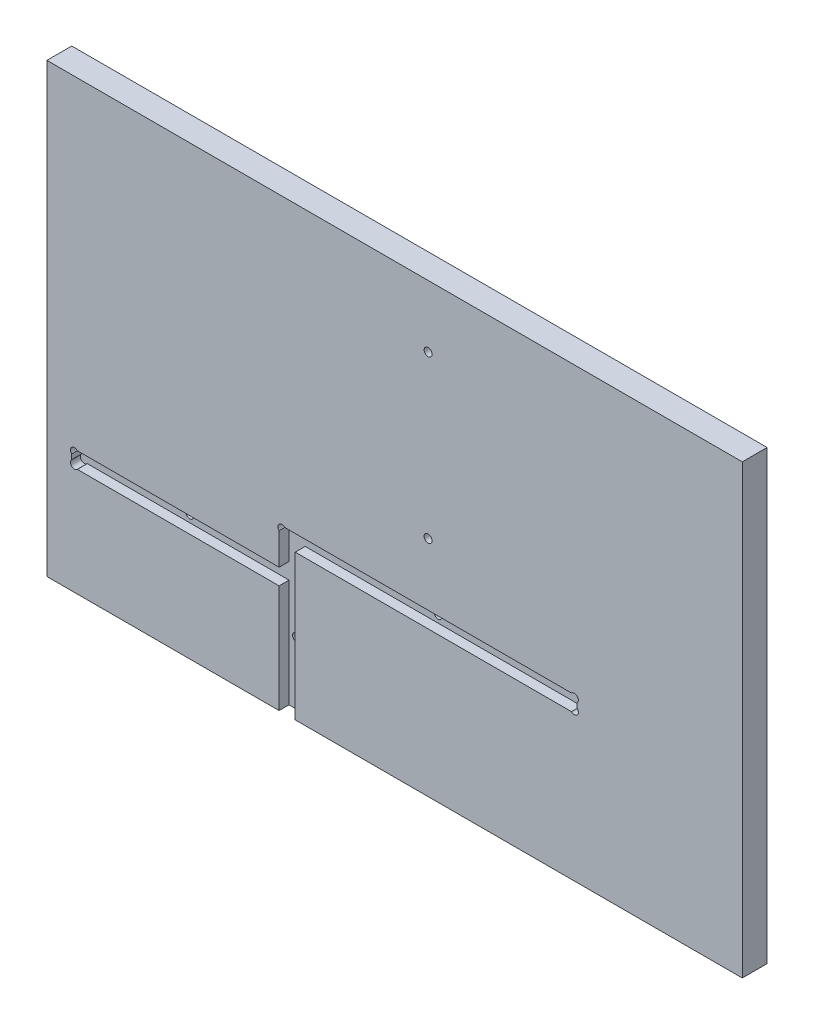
ISO-10303-21;
HEADER;
FILE_DESCRIPTION(('STEP AP214'),'2;1');
FILE_NAME('part.step','',(''),(''),'','','');
FILE_SCHEMA(('AUTOMOTIVE_DESIGN { 1 0 10303 214 1 1 1 1 }'));
ENDSEC;
DATA;
#1=APPLICATION_CONTEXT('core data for automotive mechanical design processes');
#2=APPLICATION_PROTOCOL_DEFINITION('international standard','automotive_design',2000,#1);
#3=PRODUCT_CONTEXT('',#1,'mechanical');
#4=PRODUCT('Part','Part','',(#3));
#5=PRODUCT_RELATED_PRODUCT_CATEGORY('part','',(#4));
#6=PRODUCT_DEFINITION_FORMATION('','',#4);
#7=PRODUCT_DEFINITION_CONTEXT('part definition',#1,'design');
#8=PRODUCT_DEFINITION('design','',#6,#7);
#9=PRODUCT_DEFINITION_SHAPE('','',#8);
#10=(LENGTH_UNIT() NAMED_UNIT(*) SI_UNIT(.MILLI.,.METRE.));
#11=(NAMED_UNIT(*) PLANE_ANGLE_UNIT() SI_UNIT($,.RADIAN.));
#12=(NAMED_UNIT(*) SI_UNIT($,.STERADIAN.) SOLID_ANGLE_UNIT());
#13=UNCERTAINTY_MEASURE_WITH_UNIT(LENGTH_MEASURE(1.E-05),#10,'distance_accuracy_value','');
#14=(GEOMETRIC_REPRESENTATION_CONTEXT(3) GLOBAL_UNCERTAINTY_ASSIGNED_CONTEXT((#13)) GLOBAL_UNIT_ASSIGNED_CONTEXT((#10,
#11,#12)) REPRESENTATION_CONTEXT('',''));
#15=CARTESIAN_POINT('',(0.,0.,0.));
#16=DIRECTION('',(0.,0.,1.));
#17=DIRECTION('',(1.,0.,0.));
#18=AXIS2_PLACEMENT_3D('',#15,#16,#17);
#19=CARTESIAN_POINT('',(-70.,40.,10.));
#20=DIRECTION('',(1.,0.,0.));
#21=DIRECTION('',(0.,1.,0.));
#22=AXIS2_PLACEMENT_3D('',#19,#20,#21);
#23=PLANE('',#22);
#24=DIRECTION('',(0.,-1.,0.));
#25=VECTOR('',#24,1.);
#26=CARTESIAN_POINT('',(-70.,40.,0.));
#27=LINE('',#26,#25);
#28=CARTESIAN_POINT('',(-70.,40.,0.));
#29=VERTEX_POINT('',#28);
#30=CARTESIAN_POINT('',(-70.,-140.,0.));
#31=VERTEX_POINT('',#30);
#32=EDGE_CURVE('E217',#29,#31,#27,.T.);
#33=ORIENTED_EDGE('',*,*,#32,.T.);
#34=DIRECTION('',(0.,0.,-1.));
#35=VECTOR('',#34,1.);
#36=CARTESIAN_POINT('',(-70.,-140.,10.));
#37=LINE('',#36,#35);
#38=CARTESIAN_POINT('',(-70.,-140.,10.));
#39=VERTEX_POINT('',#38);
#40=EDGE_CURVE('E11',#39,#31,#37,.T.);
#41=ORIENTED_EDGE('',*,*,#40,.F.);
#42=DIRECTION('',(0.,-1.,0.));
#43=VECTOR('',#42,1.);
#44=CARTESIAN_POINT('',(-70.,40.,10.));
#45=LINE('',#44,#43);
#46=CARTESIAN_POINT('',(-70.,40.,10.));
#47=VERTEX_POINT('',#46);
#48=EDGE_CURVE('E185',#47,#39,#45,.T.);
#49=ORIENTED_EDGE('',*,*,#48,.F.);
#50=DIRECTION('',(0.,0.,-1.));
#51=VECTOR('',#50,1.);
#52=CARTESIAN_POINT('',(-70.,40.,10.));
#53=LINE('',#52,#51);
#54=EDGE_CURVE('E196',#47,#29,#53,.T.);
#55=ORIENTED_EDGE('',*,*,#54,.T.);
#56=EDGE_LOOP('',(#33,#41,#49,#55));
#57=FACE_BOUND('',#56,.T.);
#58=ADVANCED_FACE('F27',(#57),#23,.F.);
#59=CARTESIAN_POINT('',(-70.,-140.,10.));
#60=DIRECTION('',(0.,1.,0.));
#61=DIRECTION('',(0.,0.,1.));
#62=AXIS2_PLACEMENT_3D('',#59,#60,#61);
#63=PLANE('',#62);
#64=DIRECTION('',(1.,0.,0.));
#65=VECTOR('',#64,1.);
#66=CARTESIAN_POINT('',(23.5,-140.,6.));
#67=LINE('',#66,#65);
#68=CARTESIAN_POINT('',(23.5,-140.,6.));
#69=VERTEX_POINT('',#68);
#70=CARTESIAN_POINT('',(30.,-140.,6.));
#71=VERTEX_POINT('',#70);
#72=EDGE_CURVE('E178',#69,#71,#67,.T.);
#73=ORIENTED_EDGE('',*,*,#72,.F.);
#74=DIRECTION('',(0.,0.,1.));
#75=VECTOR('',#74,1.);
#76=CARTESIAN_POINT('',(23.5,-140.,6.));
#77=LINE('',#76,#75);
#78=CARTESIAN_POINT('',(23.5,-140.,10.));
#79=VERTEX_POINT('',#78);
#80=EDGE_CURVE('E161',#69,#79,#77,.T.);
#81=ORIENTED_EDGE('',*,*,#80,.T.);
#82=DIRECTION('',(1.,0.,0.));
#83=VECTOR('',#82,1.);
#84=CARTESIAN_POINT('',(-70.,-140.,10.));
#85=LINE('',#84,#83);
#86=EDGE_CURVE('E174',#39,#79,#85,.T.);
#87=ORIENTED_EDGE('',*,*,#86,.F.);
#88=ORIENTED_EDGE('',*,*,#40,.T.);
#89=DIRECTION('',(1.,0.,0.));
#90=VECTOR('',#89,1.);
#91=CARTESIAN_POINT('',(-70.,-140.,0.));
#92=LINE('',#91,#90);
#93=CARTESIAN_POINT('',(210.,-140.,0.));
#94=VERTEX_POINT('',#93);
#95=EDGE_CURVE('E214',#31,#94,#92,.T.);
#96=ORIENTED_EDGE('',*,*,#95,.T.);
#97=DIRECTION('',(0.,0.,-1.));
#98=VECTOR('',#97,1.);
#99=CARTESIAN_POINT('',(210.,-140.,10.));
#100=LINE('',#99,#98);
#101=CARTESIAN_POINT('',(210.,-140.,10.));
#102=VERTEX_POINT('',#101);
#103=EDGE_CURVE('E34',#102,#94,#100,.T.);
#104=ORIENTED_EDGE('',*,*,#103,.F.);
#105=CARTESIAN_POINT('',(30.,-140.,10.));
#106=VERTEX_POINT('',#105);
#107=EDGE_CURVE('E188',#106,#102,#85,.T.);
#108=ORIENTED_EDGE('',*,*,#107,.F.);
#109=DIRECTION('',(0.,0.,1.));
#110=VECTOR('',#109,1.);
#111=CARTESIAN_POINT('',(30.,-140.,6.));
#112=LINE('',#111,#110);
#113=EDGE_CURVE('E179',#71,#106,#112,.T.);
#114=ORIENTED_EDGE('',*,*,#113,.F.);
#115=EDGE_LOOP('',(#73,#81,#87,#88,#96,#104,#108,#114));
#116=FACE_BOUND('',#115,.T.);
#117=ADVANCED_FACE('F173',(#116),#63,.F.);
#118=CARTESIAN_POINT('',(210.,40.,10.));
#119=DIRECTION('',(-1.,0.,0.));
#120=DIRECTION('',(0.,0.,1.));
#121=AXIS2_PLACEMENT_3D('',#118,#119,#120);
#122=PLANE('',#121);
#123=DIRECTION('',(0.,1.,0.));
#124=VECTOR('',#123,1.);
#125=CARTESIAN_POINT('',(210.,40.,0.));
#126=LINE('',#125,#124);
#127=CARTESIAN_POINT('',(210.,40.,0.));
#128=VERTEX_POINT('',#127);
#129=EDGE_CURVE('E208',#94,#128,#126,.T.);
#130=ORIENTED_EDGE('',*,*,#129,.T.);
#131=DIRECTION('',(0.,0.,-1.));
#132=VECTOR('',#131,1.);
#133=CARTESIAN_POINT('',(210.,40.,10.));
#134=LINE('',#133,#132);
#135=CARTESIAN_POINT('',(210.,40.,10.));
#136=VERTEX_POINT('',#135);
#137=EDGE_CURVE('E199',#136,#128,#134,.T.);
#138=ORIENTED_EDGE('',*,*,#137,.F.);
#139=DIRECTION('',(0.,1.,0.));
#140=VECTOR('',#139,1.);
#141=CARTESIAN_POINT('',(210.,40.,10.));
#142=LINE('',#141,#140);
#143=EDGE_CURVE('E187',#102,#136,#142,.T.);
#144=ORIENTED_EDGE('',*,*,#143,.F.);
#145=ORIENTED_EDGE('',*,*,#103,.T.);
#146=EDGE_LOOP('',(#130,#138,#144,#145));
#147=FACE_BOUND('',#146,.T.);
#148=ADVANCED_FACE('F206',(#147),#122,.F.);
#149=CARTESIAN_POINT('',(-70.,40.,10.));
#150=DIRECTION('',(0.,-1.,0.));
#151=DIRECTION('',(0.,0.,-1.));
#152=AXIS2_PLACEMENT_3D('',#149,#150,#151);
#153=PLANE('',#152);
#154=DIRECTION('',(-1.,0.,0.));
#155=VECTOR('',#154,1.);
#156=CARTESIAN_POINT('',(-70.,40.,0.));
#157=LINE('',#156,#155);
#158=EDGE_CURVE('E215',#128,#29,#157,.T.);
#159=ORIENTED_EDGE('',*,*,#158,.T.);
#160=ORIENTED_EDGE('',*,*,#54,.F.);
#161=DIRECTION('',(-1.,0.,0.));
#162=VECTOR('',#161,1.);
#163=CARTESIAN_POINT('',(-70.,40.,10.));
#164=LINE('',#163,#162);
#165=EDGE_CURVE('E190',#136,#47,#164,.T.);
#166=ORIENTED_EDGE('',*,*,#165,.F.);
#167=ORIENTED_EDGE('',*,*,#137,.T.);
#168=EDGE_LOOP('',(#159,#160,#166,#167));
#169=FACE_BOUND('',#168,.T.);
#170=ADVANCED_FACE('F424',(#169),#153,.F.);
#171=CARTESIAN_POINT('',(-70.,-140.,10.));
#172=DIRECTION('',(0.,0.,1.));
#173=DIRECTION('',(1.,0.,0.));
#174=AXIS2_PLACEMENT_3D('',#171,#172,#173);
#175=PLANE('',#174);
#176=DIRECTION('',(-1.,0.,0.));
#177=VECTOR('',#176,1.);
#178=CARTESIAN_POINT('',(-60.,-90.,10.));
#179=LINE('',#178,#177);
#180=CARTESIAN_POINT('',(23.5,-90.,10.));
#181=VERTEX_POINT('',#180);
#182=CARTESIAN_POINT('',(-57.7381049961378,-90.,10.));
#183=VERTEX_POINT('',#182);
#184=EDGE_CURVE('E247',#181,#183,#179,.T.);
#185=ORIENTED_EDGE('',*,*,#184,.F.);
#186=DIRECTION('',(0.,-1.,0.));
#187=VECTOR('',#186,1.);
#188=CARTESIAN_POINT('',(23.5,-75.,10.));
#189=LINE('',#188,#187);
#190=CARTESIAN_POINT('',(23.5,-77.2618950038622,10.));
#191=VERTEX_POINT('',#190);
#192=EDGE_CURVE('E237',#191,#181,#189,.T.);
#193=ORIENTED_EDGE('',*,*,#192,.F.);
#194=CARTESIAN_POINT('',(24.6,-76.1,10.));
#195=DIRECTION('',(0.,0.,1.));
#196=DIRECTION('',(1.,0.,0.));
#197=AXIS2_PLACEMENT_3D('',#194,#195,#196);
#198=CIRCLE('',#197,1.60000000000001);
#199=CARTESIAN_POINT('',(25.7618950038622,-75.,10.));
#200=VERTEX_POINT('',#199);
#201=EDGE_CURVE('E286',#200,#191,#198,.T.);
#202=ORIENTED_EDGE('',*,*,#201,.F.);
#203=DIRECTION('',(-1.,0.,0.));
#204=VECTOR('',#203,1.);
#205=CARTESIAN_POINT('',(23.5,-75.,10.));
#206=LINE('',#205,#204);
#207=CARTESIAN_POINT('',(141.238104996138,-75.,10.));
#208=VERTEX_POINT('',#207);
#209=EDGE_CURVE('E230',#208,#200,#206,.T.);
#210=ORIENTED_EDGE('',*,*,#209,.F.);
#211=CARTESIAN_POINT('',(142.4,-76.1,10.));
#212=DIRECTION('',(0.,0.,1.));
#213=DIRECTION('',(1.,0.,0.));
#214=AXIS2_PLACEMENT_3D('',#211,#212,#213);
#215=CIRCLE('',#214,1.59999999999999);
#216=CARTESIAN_POINT('',(143.5,-77.2618950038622,10.));
#217=VERTEX_POINT('',#216);
#218=EDGE_CURVE('E265',#217,#208,#215,.T.);
#219=ORIENTED_EDGE('',*,*,#218,.F.);
#220=DIRECTION('',(0.,1.,0.));
#221=VECTOR('',#220,1.);
#222=CARTESIAN_POINT('',(143.5,-75.,10.));
#223=LINE('',#222,#221);
#224=CARTESIAN_POINT('',(143.5,-79.2381049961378,10.));
#225=VERTEX_POINT('',#224);
#226=EDGE_CURVE('E233',#225,#217,#223,.T.);
#227=ORIENTED_EDGE('',*,*,#226,.F.);
#228=CARTESIAN_POINT('',(142.4,-80.4,10.));
#229=DIRECTION('',(0.,0.,1.));
#230=DIRECTION('',(1.,0.,0.));
#231=AXIS2_PLACEMENT_3D('',#228,#229,#230);
#232=CIRCLE('',#231,1.59999999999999);
#233=CARTESIAN_POINT('',(141.238104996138,-81.5,10.));
#234=VERTEX_POINT('',#233);
#235=EDGE_CURVE('E276',#234,#225,#232,.T.);
#236=ORIENTED_EDGE('',*,*,#235,.F.);
#237=DIRECTION('',(1.,0.,0.));
#238=VECTOR('',#237,1.);
#239=CARTESIAN_POINT('',(23.5,-81.5,10.));
#240=LINE('',#239,#238);
#241=CARTESIAN_POINT('',(30.,-81.5,10.));
#242=VERTEX_POINT('',#241);
#243=EDGE_CURVE('E235',#242,#234,#240,.T.);
#244=ORIENTED_EDGE('',*,*,#243,.F.);
#245=DIRECTION('',(0.,1.,0.));
#246=VECTOR('',#245,1.);
#247=CARTESIAN_POINT('',(30.,-90.,10.));
#248=LINE('',#247,#246);
#249=EDGE_CURVE('E249',#106,#242,#248,.T.);
#250=ORIENTED_EDGE('',*,*,#249,.F.);
#251=ORIENTED_EDGE('',*,*,#107,.T.);
#252=ORIENTED_EDGE('',*,*,#143,.T.);
#253=ORIENTED_EDGE('',*,*,#165,.T.);
#254=ORIENTED_EDGE('',*,*,#48,.T.);
#255=ORIENTED_EDGE('',*,*,#86,.T.);
#256=DIRECTION('',(0.,-1.,0.));
#257=VECTOR('',#256,1.);
#258=CARTESIAN_POINT('',(23.5,-81.5,10.));
#259=LINE('',#258,#257);
#260=CARTESIAN_POINT('',(23.5,-96.5,10.));
#261=VERTEX_POINT('',#260);
#262=EDGE_CURVE('E158',#261,#79,#259,.T.);
#263=ORIENTED_EDGE('',*,*,#262,.F.);
#264=DIRECTION('',(1.,0.,0.));
#265=VECTOR('',#264,1.);
#266=CARTESIAN_POINT('',(-60.,-96.5,10.));
#267=LINE('',#266,#265);
#268=CARTESIAN_POINT('',(-57.7381049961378,-96.5,10.));
#269=VERTEX_POINT('',#268);
#270=EDGE_CURVE('E251',#269,#261,#267,.T.);
#271=ORIENTED_EDGE('',*,*,#270,.F.);
#272=CARTESIAN_POINT('',(-58.9,-95.4,10.));
#273=DIRECTION('',(0.,0.,1.));
#274=DIRECTION('',(1.,0.,0.));
#275=AXIS2_PLACEMENT_3D('',#272,#273,#274);
#276=CIRCLE('',#275,1.6);
#277=CARTESIAN_POINT('',(-60.,-94.2381049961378,10.));
#278=VERTEX_POINT('',#277);
#279=EDGE_CURVE('E306',#278,#269,#276,.T.);
#280=ORIENTED_EDGE('',*,*,#279,.F.);
#281=DIRECTION('',(0.,-1.,0.));
#282=VECTOR('',#281,1.);
#283=CARTESIAN_POINT('',(-60.,-90.,10.));
#284=LINE('',#283,#282);
#285=CARTESIAN_POINT('',(-60.,-92.2618950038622,10.));
#286=VERTEX_POINT('',#285);
#287=EDGE_CURVE('E253',#286,#278,#284,.T.);
#288=ORIENTED_EDGE('',*,*,#287,.F.);
#289=CARTESIAN_POINT('',(-58.9,-91.1,10.));
#290=DIRECTION('',(0.,0.,1.));
#291=DIRECTION('',(1.,0.,0.));
#292=AXIS2_PLACEMENT_3D('',#289,#290,#291);
#293=CIRCLE('',#292,1.6);
#294=EDGE_CURVE('E297',#183,#286,#293,.T.);
#295=ORIENTED_EDGE('',*,*,#294,.F.);
#296=EDGE_LOOP('',(#185,#193,#202,#210,#219,#227,#236,#244,#250,#251,#252,#253,#254,#255,#263,
#271,#280,#288,#295));
#297=FACE_BOUND('',#296,.T.);
#298=CARTESIAN_POINT('',(83.4999999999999,15.,10.));
#299=DIRECTION('',(0.,0.,1.));
#300=DIRECTION('',(1.,0.,0.));
#301=AXIS2_PLACEMENT_3D('',#298,#299,#300);
#302=CIRCLE('',#301,1.6);
#303=CARTESIAN_POINT('',(85.1,15.,10.));
#304=VERTEX_POINT('',#303);
#305=EDGE_CURVE('E317',#304,#304,#302,.T.);
#306=ORIENTED_EDGE('',*,*,#305,.F.);
#307=EDGE_LOOP('',(#306));
#308=FACE_BOUND('',#307,.T.);
#309=CARTESIAN_POINT('',(83.5,-50.,10.));
#310=DIRECTION('',(0.,0.,1.));
#311=DIRECTION('',(1.,0.,0.));
#312=AXIS2_PLACEMENT_3D('',#309,#310,#311);
#313=CIRCLE('',#312,1.60000000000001);
#314=CARTESIAN_POINT('',(85.1,-50.,10.));
#315=VERTEX_POINT('',#314);
#316=EDGE_CURVE('E311',#315,#315,#313,.T.);
#317=ORIENTED_EDGE('',*,*,#316,.F.);
#318=EDGE_LOOP('',(#317));
#319=FACE_BOUND('',#318,.T.);
#320=ADVANCED_FACE('F182',(#297,#308,#319),#175,.T.);
#321=CARTESIAN_POINT('',(-70.,-140.,0.));
#322=DIRECTION('',(0.,0.,1.));
#323=DIRECTION('',(1.,0.,0.));
#324=AXIS2_PLACEMENT_3D('',#321,#322,#323);
#325=PLANE('',#324);
#326=CARTESIAN_POINT('',(-16.5,-93.5,0.));
#327=DIRECTION('',(0.,0.,1.));
#328=DIRECTION('',(1.,0.,0.));
#329=AXIS2_PLACEMENT_3D('',#326,#327,#328);
#330=CIRCLE('',#329,1.6);
#331=CARTESIAN_POINT('',(-14.9,-93.5,0.));
#332=VERTEX_POINT('',#331);
#333=EDGE_CURVE('E342',#332,#332,#330,.T.);
#334=ORIENTED_EDGE('',*,*,#333,.T.);
#335=EDGE_LOOP('',(#334));
#336=FACE_BOUND('',#335,.T.);
#337=CARTESIAN_POINT('',(26.5,-115.,0.));
#338=DIRECTION('',(0.,0.,1.));
#339=DIRECTION('',(1.,0.,0.));
#340=AXIS2_PLACEMENT_3D('',#337,#338,#339);
#341=CIRCLE('',#340,1.60000000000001);
#342=CARTESIAN_POINT('',(28.1,-115.,0.));
#343=VERTEX_POINT('',#342);
#344=EDGE_CURVE('E336',#343,#343,#341,.T.);
#345=ORIENTED_EDGE('',*,*,#344,.T.);
#346=EDGE_LOOP('',(#345));
#347=FACE_BOUND('',#346,.T.);
#348=CARTESIAN_POINT('',(83.4999999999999,-78.5,0.));
#349=DIRECTION('',(0.,0.,1.));
#350=DIRECTION('',(1.,0.,0.));
#351=AXIS2_PLACEMENT_3D('',#348,#349,#350);
#352=CIRCLE('',#351,1.60000000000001);
#353=CARTESIAN_POINT('',(85.1,-78.5,0.));
#354=VERTEX_POINT('',#353);
#355=EDGE_CURVE('E170',#354,#354,#352,.T.);
#356=ORIENTED_EDGE('',*,*,#355,.T.);
#357=EDGE_LOOP('',(#356));
#358=FACE_BOUND('',#357,.T.);
#359=CARTESIAN_POINT('',(83.4999999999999,15.,0.));
#360=DIRECTION('',(0.,0.,1.));
#361=DIRECTION('',(1.,0.,0.));
#362=AXIS2_PLACEMENT_3D('',#359,#360,#361);
#363=CIRCLE('',#362,1.6);
#364=CARTESIAN_POINT('',(85.1,15.,0.));
#365=VERTEX_POINT('',#364);
#366=EDGE_CURVE('E314',#365,#365,#363,.T.);
#367=ORIENTED_EDGE('',*,*,#366,.T.);
#368=EDGE_LOOP('',(#367));
#369=FACE_BOUND('',#368,.T.);
#370=CARTESIAN_POINT('',(83.5,-50.,0.));
#371=DIRECTION('',(0.,0.,1.));
#372=DIRECTION('',(1.,0.,0.));
#373=AXIS2_PLACEMENT_3D('',#370,#371,#372);
#374=CIRCLE('',#373,1.60000000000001);
#375=CARTESIAN_POINT('',(85.1,-50.,0.));
#376=VERTEX_POINT('',#375);
#377=EDGE_CURVE('E308',#376,#376,#374,.T.);
#378=ORIENTED_EDGE('',*,*,#377,.T.);
#379=EDGE_LOOP('',(#378));
#380=FACE_BOUND('',#379,.T.);
#381=ORIENTED_EDGE('',*,*,#32,.F.);
#382=ORIENTED_EDGE('',*,*,#158,.F.);
#383=ORIENTED_EDGE('',*,*,#129,.F.);
#384=ORIENTED_EDGE('',*,*,#95,.F.);
#385=EDGE_LOOP('',(#381,#382,#383,#384));
#386=FACE_BOUND('',#385,.T.);
#387=ADVANCED_FACE('F213',(#336,#347,#358,#369,#380,#386),#325,.F.);
#388=CARTESIAN_POINT('',(23.5,-75.,6.));
#389=DIRECTION('',(-1.,0.,0.));
#390=DIRECTION('',(0.,-1.,0.));
#391=AXIS2_PLACEMENT_3D('',#388,#389,#390);
#392=PLANE('',#391);
#393=DIRECTION('',(0.,-1.,0.));
#394=VECTOR('',#393,1.);
#395=CARTESIAN_POINT('',(23.5,-75.,6.));
#396=LINE('',#395,#394);
#397=CARTESIAN_POINT('',(23.5,-77.2618950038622,6.));
#398=VERTEX_POINT('',#397);
#399=CARTESIAN_POINT('',(23.4999999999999,-90.,6.));
#400=VERTEX_POINT('',#399);
#401=EDGE_CURVE('E41',#398,#400,#396,.T.);
#402=ORIENTED_EDGE('',*,*,#401,.F.);
#403=DIRECTION('',(0.,0.,1.));
#404=VECTOR('',#403,1.);
#405=CARTESIAN_POINT('',(23.5,-77.2618950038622,6.));
#406=LINE('',#405,#404);
#407=EDGE_CURVE('E278',#398,#191,#406,.T.);
#408=ORIENTED_EDGE('',*,*,#407,.T.);
#409=ORIENTED_EDGE('',*,*,#192,.T.);
#410=DIRECTION('',(0.,0.,1.));
#411=VECTOR('',#410,1.);
#412=CARTESIAN_POINT('',(23.4999999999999,-90.,6.));
#413=LINE('',#412,#411);
#414=EDGE_CURVE('E320',#400,#181,#413,.T.);
#415=ORIENTED_EDGE('',*,*,#414,.F.);
#416=EDGE_LOOP('',(#402,#408,#409,#415));
#417=FACE_BOUND('',#416,.T.);
#418=ADVANCED_FACE('F363',(#417),#392,.F.);
#419=CARTESIAN_POINT('',(23.5,-75.,6.));
#420=DIRECTION('',(0.,1.,0.));
#421=DIRECTION('',(-1.,0.,0.));
#422=AXIS2_PLACEMENT_3D('',#419,#420,#421);
#423=PLANE('',#422);
#424=ORIENTED_EDGE('',*,*,#209,.T.);
#425=DIRECTION('',(0.,0.,1.));
#426=VECTOR('',#425,1.);
#427=CARTESIAN_POINT('',(25.7618950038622,-75.,6.));
#428=LINE('',#427,#426);
#429=CARTESIAN_POINT('',(25.7618950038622,-75.,6.));
#430=VERTEX_POINT('',#429);
#431=EDGE_CURVE('E281',#200,#430,#428,.F.);
#432=ORIENTED_EDGE('',*,*,#431,.T.);
#433=DIRECTION('',(-1.,0.,0.));
#434=VECTOR('',#433,1.);
#435=CARTESIAN_POINT('',(23.5,-75.,6.));
#436=LINE('',#435,#434);
#437=CARTESIAN_POINT('',(141.238104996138,-75.,6.));
#438=VERTEX_POINT('',#437);
#439=EDGE_CURVE('E222',#438,#430,#436,.T.);
#440=ORIENTED_EDGE('',*,*,#439,.F.);
#441=DIRECTION('',(0.,0.,1.));
#442=VECTOR('',#441,1.);
#443=CARTESIAN_POINT('',(141.238104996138,-75.,6.));
#444=LINE('',#443,#442);
#445=EDGE_CURVE('E256',#438,#208,#444,.T.);
#446=ORIENTED_EDGE('',*,*,#445,.T.);
#447=EDGE_LOOP('',(#424,#432,#440,#446));
#448=FACE_BOUND('',#447,.T.);
#449=ADVANCED_FACE('F405',(#448),#423,.F.);
#450=CARTESIAN_POINT('',(143.5,-75.,6.));
#451=DIRECTION('',(1.,0.,0.));
#452=DIRECTION('',(0.,0.,-1.));
#453=AXIS2_PLACEMENT_3D('',#450,#451,#452);
#454=PLANE('',#453);
#455=DIRECTION('',(0.,1.,0.));
#456=VECTOR('',#455,1.);
#457=CARTESIAN_POINT('',(143.5,-75.,6.));
#458=LINE('',#457,#456);
#459=CARTESIAN_POINT('',(143.5,-79.2381049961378,6.));
#460=VERTEX_POINT('',#459);
#461=CARTESIAN_POINT('',(143.5,-77.2618950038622,6.));
#462=VERTEX_POINT('',#461);
#463=EDGE_CURVE('E225',#460,#462,#458,.T.);
#464=ORIENTED_EDGE('',*,*,#463,.F.);
#465=DIRECTION('',(0.,0.,1.));
#466=VECTOR('',#465,1.);
#467=CARTESIAN_POINT('',(143.5,-79.2381049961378,6.));
#468=LINE('',#467,#466);
#469=EDGE_CURVE('E267',#460,#225,#468,.T.);
#470=ORIENTED_EDGE('',*,*,#469,.T.);
#471=ORIENTED_EDGE('',*,*,#226,.T.);
#472=DIRECTION('',(0.,0.,1.));
#473=VECTOR('',#472,1.);
#474=CARTESIAN_POINT('',(143.5,-77.2618950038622,6.));
#475=LINE('',#474,#473);
#476=EDGE_CURVE('E259',#217,#462,#475,.F.);
#477=ORIENTED_EDGE('',*,*,#476,.T.);
#478=EDGE_LOOP('',(#464,#470,#471,#477));
#479=FACE_BOUND('',#478,.T.);
#480=ADVANCED_FACE('F396',(#479),#454,.F.);
#481=CARTESIAN_POINT('',(23.5,-81.5,6.));
#482=DIRECTION('',(0.,-1.,0.));
#483=DIRECTION('',(0.,0.,-1.));
#484=AXIS2_PLACEMENT_3D('',#481,#482,#483);
#485=PLANE('',#484);
#486=DIRECTION('',(1.,0.,0.));
#487=VECTOR('',#486,1.);
#488=CARTESIAN_POINT('',(23.5,-81.5,6.));
#489=LINE('',#488,#487);
#490=CARTESIAN_POINT('',(30.,-81.5,6.));
#491=VERTEX_POINT('',#490);
#492=CARTESIAN_POINT('',(141.238104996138,-81.5,6.));
#493=VERTEX_POINT('',#492);
#494=EDGE_CURVE('E227',#491,#493,#489,.T.);
#495=ORIENTED_EDGE('',*,*,#494,.F.);
#496=DIRECTION('',(0.,0.,1.));
#497=VECTOR('',#496,1.);
#498=CARTESIAN_POINT('',(30.,-81.5,6.));
#499=LINE('',#498,#497);
#500=EDGE_CURVE('E323',#491,#242,#499,.T.);
#501=ORIENTED_EDGE('',*,*,#500,.T.);
#502=ORIENTED_EDGE('',*,*,#243,.T.);
#503=DIRECTION('',(0.,0.,1.));
#504=VECTOR('',#503,1.);
#505=CARTESIAN_POINT('',(141.238104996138,-81.5,6.));
#506=LINE('',#505,#504);
#507=EDGE_CURVE('E270',#234,#493,#506,.F.);
#508=ORIENTED_EDGE('',*,*,#507,.T.);
#509=EDGE_LOOP('',(#495,#501,#502,#508));
#510=FACE_BOUND('',#509,.T.);
#511=ADVANCED_FACE('F355',(#510),#485,.F.);
#512=CARTESIAN_POINT('',(23.5,-81.5,6.));
#513=DIRECTION('',(0.,0.,1.));
#514=DIRECTION('',(1.,0.,0.));
#515=AXIS2_PLACEMENT_3D('',#512,#513,#514);
#516=PLANE('',#515);
#517=CARTESIAN_POINT('',(-16.5,-93.5,6.));
#518=DIRECTION('',(0.,0.,1.));
#519=DIRECTION('',(1.,0.,0.));
#520=AXIS2_PLACEMENT_3D('',#517,#518,#519);
#521=CIRCLE('',#520,1.6);
#522=CARTESIAN_POINT('',(-14.9,-93.5,6.));
#523=VERTEX_POINT('',#522);
#524=EDGE_CURVE('E345',#523,#523,#521,.T.);
#525=ORIENTED_EDGE('',*,*,#524,.F.);
#526=EDGE_LOOP('',(#525));
#527=FACE_BOUND('',#526,.T.);
#528=CARTESIAN_POINT('',(26.5,-115.,6.));
#529=DIRECTION('',(0.,0.,1.));
#530=DIRECTION('',(1.,0.,0.));
#531=AXIS2_PLACEMENT_3D('',#528,#529,#530);
#532=CIRCLE('',#531,1.60000000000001);
#533=CARTESIAN_POINT('',(28.1,-115.,6.));
#534=VERTEX_POINT('',#533);
#535=EDGE_CURVE('E339',#534,#534,#532,.T.);
#536=ORIENTED_EDGE('',*,*,#535,.F.);
#537=EDGE_LOOP('',(#536));
#538=FACE_BOUND('',#537,.T.);
#539=CARTESIAN_POINT('',(83.4999999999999,-78.5,6.));
#540=DIRECTION('',(0.,0.,1.));
#541=DIRECTION('',(1.,0.,0.));
#542=AXIS2_PLACEMENT_3D('',#539,#540,#541);
#543=CIRCLE('',#542,1.60000000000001);
#544=CARTESIAN_POINT('',(85.1,-78.5,6.));
#545=VERTEX_POINT('',#544);
#546=EDGE_CURVE('E333',#545,#545,#543,.T.);
#547=ORIENTED_EDGE('',*,*,#546,.F.);
#548=EDGE_LOOP('',(#547));
#549=FACE_BOUND('',#548,.T.);
#550=CARTESIAN_POINT('',(24.6,-76.1,6.));
#551=DIRECTION('',(0.,0.,1.));
#552=DIRECTION('',(1.,0.,0.));
#553=AXIS2_PLACEMENT_3D('',#550,#551,#552);
#554=CIRCLE('',#553,1.60000000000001);
#555=EDGE_CURVE('E284',#430,#398,#554,.T.);
#556=ORIENTED_EDGE('',*,*,#555,.T.);
#557=ORIENTED_EDGE('',*,*,#401,.T.);
#558=DIRECTION('',(-1.,0.,0.));
#559=VECTOR('',#558,1.);
#560=CARTESIAN_POINT('',(-60.,-90.,6.));
#561=LINE('',#560,#559);
#562=CARTESIAN_POINT('',(-57.7381049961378,-90.,6.));
#563=VERTEX_POINT('',#562);
#564=EDGE_CURVE('E239',#400,#563,#561,.T.);
#565=ORIENTED_EDGE('',*,*,#564,.T.);
#566=CARTESIAN_POINT('',(-58.9,-91.1,6.));
#567=DIRECTION('',(0.,0.,1.));
#568=DIRECTION('',(1.,0.,0.));
#569=AXIS2_PLACEMENT_3D('',#566,#567,#568);
#570=CIRCLE('',#569,1.6);
#571=CARTESIAN_POINT('',(-60.,-92.2618950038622,6.));
#572=VERTEX_POINT('',#571);
#573=EDGE_CURVE('E294',#563,#572,#570,.T.);
#574=ORIENTED_EDGE('',*,*,#573,.T.);
#575=DIRECTION('',(0.,-1.,0.));
#576=VECTOR('',#575,1.);
#577=CARTESIAN_POINT('',(-60.,-90.,6.));
#578=LINE('',#577,#576);
#579=CARTESIAN_POINT('',(-60.,-94.2381049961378,6.));
#580=VERTEX_POINT('',#579);
#581=EDGE_CURVE('E245',#572,#580,#578,.T.);
#582=ORIENTED_EDGE('',*,*,#581,.T.);
#583=CARTESIAN_POINT('',(-58.9,-95.4,6.));
#584=DIRECTION('',(0.,0.,1.));
#585=DIRECTION('',(1.,0.,0.));
#586=AXIS2_PLACEMENT_3D('',#583,#584,#585);
#587=CIRCLE('',#586,1.6);
#588=CARTESIAN_POINT('',(-57.7381049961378,-96.5,6.));
#589=VERTEX_POINT('',#588);
#590=EDGE_CURVE('E48',#580,#589,#587,.T.);
#591=ORIENTED_EDGE('',*,*,#590,.T.);
#592=DIRECTION('',(1.,0.,0.));
#593=VECTOR('',#592,1.);
#594=CARTESIAN_POINT('',(-60.,-96.5,6.));
#595=LINE('',#594,#593);
#596=CARTESIAN_POINT('',(23.5,-96.5,6.));
#597=VERTEX_POINT('',#596);
#598=EDGE_CURVE('E243',#589,#597,#595,.T.);
#599=ORIENTED_EDGE('',*,*,#598,.T.);
#600=DIRECTION('',(0.,-1.,0.));
#601=VECTOR('',#600,1.);
#602=CARTESIAN_POINT('',(23.5,-81.5,6.));
#603=LINE('',#602,#601);
#604=EDGE_CURVE('E169',#597,#69,#603,.T.);
#605=ORIENTED_EDGE('',*,*,#604,.T.);
#606=ORIENTED_EDGE('',*,*,#72,.T.);
#607=DIRECTION('',(0.,1.,0.));
#608=VECTOR('',#607,1.);
#609=CARTESIAN_POINT('',(30.,-90.,6.));
#610=LINE('',#609,#608);
#611=EDGE_CURVE('E241',#71,#491,#610,.T.);
#612=ORIENTED_EDGE('',*,*,#611,.T.);
#613=ORIENTED_EDGE('',*,*,#494,.T.);
#614=CARTESIAN_POINT('',(142.4,-80.4,6.));
#615=DIRECTION('',(0.,0.,1.));
#616=DIRECTION('',(1.,0.,0.));
#617=AXIS2_PLACEMENT_3D('',#614,#615,#616);
#618=CIRCLE('',#617,1.59999999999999);
#619=EDGE_CURVE('E273',#493,#460,#618,.T.);
#620=ORIENTED_EDGE('',*,*,#619,.T.);
#621=ORIENTED_EDGE('',*,*,#463,.T.);
#622=CARTESIAN_POINT('',(142.4,-76.1,6.));
#623=DIRECTION('',(0.,0.,1.));
#624=DIRECTION('',(1.,0.,0.));
#625=AXIS2_PLACEMENT_3D('',#622,#623,#624);
#626=CIRCLE('',#625,1.59999999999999);
#627=EDGE_CURVE('E262',#462,#438,#626,.T.);
#628=ORIENTED_EDGE('',*,*,#627,.T.);
#629=ORIENTED_EDGE('',*,*,#439,.T.);
#630=EDGE_LOOP('',(#556,#557,#565,#574,#582,#591,#599,#605,#606,#612,#613,#620,#621,#628,#629));
#631=FACE_BOUND('',#630,.T.);
#632=ADVANCED_FACE('F351',(#527,#538,#549,#631),#516,.T.);
#633=CARTESIAN_POINT('',(-60.,-90.,6.));
#634=DIRECTION('',(-1.,0.,0.));
#635=DIRECTION('',(0.,0.,1.));
#636=AXIS2_PLACEMENT_3D('',#633,#634,#635);
#637=PLANE('',#636);
#638=ORIENTED_EDGE('',*,*,#287,.T.);
#639=DIRECTION('',(0.,0.,1.));
#640=VECTOR('',#639,1.);
#641=CARTESIAN_POINT('',(-60.,-94.2381049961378,6.));
#642=LINE('',#641,#640);
#643=EDGE_CURVE('E299',#278,#580,#642,.F.);
#644=ORIENTED_EDGE('',*,*,#643,.T.);
#645=ORIENTED_EDGE('',*,*,#581,.F.);
#646=DIRECTION('',(0.,0.,1.));
#647=VECTOR('',#646,1.);
#648=CARTESIAN_POINT('',(-60.,-92.2618950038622,6.));
#649=LINE('',#648,#647);
#650=EDGE_CURVE('E288',#572,#286,#649,.T.);
#651=ORIENTED_EDGE('',*,*,#650,.T.);
#652=EDGE_LOOP('',(#638,#644,#645,#651));
#653=FACE_BOUND('',#652,.T.);
#654=ADVANCED_FACE('F354',(#653),#637,.F.);
#655=CARTESIAN_POINT('',(-60.,-90.,6.));
#656=DIRECTION('',(0.,1.,0.));
#657=DIRECTION('',(0.,0.,1.));
#658=AXIS2_PLACEMENT_3D('',#655,#656,#657);
#659=PLANE('',#658);
#660=ORIENTED_EDGE('',*,*,#564,.F.);
#661=ORIENTED_EDGE('',*,*,#414,.T.);
#662=ORIENTED_EDGE('',*,*,#184,.T.);
#663=DIRECTION('',(0.,0.,1.));
#664=VECTOR('',#663,1.);
#665=CARTESIAN_POINT('',(-57.7381049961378,-90.,6.));
#666=LINE('',#665,#664);
#667=EDGE_CURVE('E291',#183,#563,#666,.F.);
#668=ORIENTED_EDGE('',*,*,#667,.T.);
#669=EDGE_LOOP('',(#660,#661,#662,#668));
#670=FACE_BOUND('',#669,.T.);
#671=ADVANCED_FACE('F367',(#670),#659,.F.);
#672=CARTESIAN_POINT('',(30.,-90.,6.));
#673=DIRECTION('',(1.,0.,0.));
#674=DIRECTION('',(0.,0.,-1.));
#675=AXIS2_PLACEMENT_3D('',#672,#673,#674);
#676=PLANE('',#675);
#677=ORIENTED_EDGE('',*,*,#249,.T.);
#678=ORIENTED_EDGE('',*,*,#500,.F.);
#679=ORIENTED_EDGE('',*,*,#611,.F.);
#680=ORIENTED_EDGE('',*,*,#113,.T.);
#681=EDGE_LOOP('',(#677,#678,#679,#680));
#682=FACE_BOUND('',#681,.T.);
#683=ADVANCED_FACE('F384',(#682),#676,.F.);
#684=CARTESIAN_POINT('',(-60.,-96.5,6.));
#685=DIRECTION('',(0.,-1.,0.));
#686=DIRECTION('',(0.,0.,-1.));
#687=AXIS2_PLACEMENT_3D('',#684,#685,#686);
#688=PLANE('',#687);
#689=ORIENTED_EDGE('',*,*,#270,.T.);
#690=DIRECTION('',(0.,0.,-1.));
#691=VECTOR('',#690,1.);
#692=CARTESIAN_POINT('',(23.4999999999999,-96.5,6.));
#693=LINE('',#692,#691);
#694=EDGE_CURVE('E164',#261,#597,#693,.T.);
#695=ORIENTED_EDGE('',*,*,#694,.T.);
#696=ORIENTED_EDGE('',*,*,#598,.F.);
#697=DIRECTION('',(0.,0.,1.));
#698=VECTOR('',#697,1.);
#699=CARTESIAN_POINT('',(-57.7381049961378,-96.5,6.));
#700=LINE('',#699,#698);
#701=EDGE_CURVE('E302',#589,#269,#700,.T.);
#702=ORIENTED_EDGE('',*,*,#701,.T.);
#703=EDGE_LOOP('',(#689,#695,#696,#702));
#704=FACE_BOUND('',#703,.T.);
#705=ADVANCED_FACE('F381',(#704),#688,.F.);
#706=CARTESIAN_POINT('',(142.4,-76.1,6.));
#707=DIRECTION('',(0.,0.,1.));
#708=DIRECTION('',(1.,0.,0.));
#709=AXIS2_PLACEMENT_3D('',#706,#707,#708);
#710=CYLINDRICAL_SURFACE('',#709,1.59999999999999);
#711=ORIENTED_EDGE('',*,*,#627,.F.);
#712=ORIENTED_EDGE('',*,*,#476,.F.);
#713=ORIENTED_EDGE('',*,*,#218,.T.);
#714=ORIENTED_EDGE('',*,*,#445,.F.);
#715=EDGE_LOOP('',(#711,#712,#713,#714));
#716=FACE_BOUND('',#715,.T.);
#717=ADVANCED_FACE('F403',(#716),#710,.F.);
#718=CARTESIAN_POINT('',(142.4,-80.4,6.));
#719=DIRECTION('',(0.,0.,1.));
#720=DIRECTION('',(1.,0.,0.));
#721=AXIS2_PLACEMENT_3D('',#718,#719,#720);
#722=CYLINDRICAL_SURFACE('',#721,1.59999999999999);
#723=ORIENTED_EDGE('',*,*,#619,.F.);
#724=ORIENTED_EDGE('',*,*,#507,.F.);
#725=ORIENTED_EDGE('',*,*,#235,.T.);
#726=ORIENTED_EDGE('',*,*,#469,.F.);
#727=EDGE_LOOP('',(#723,#724,#725,#726));
#728=FACE_BOUND('',#727,.T.);
#729=ADVANCED_FACE('F392',(#728),#722,.F.);
#730=CARTESIAN_POINT('',(24.6,-76.1,6.));
#731=DIRECTION('',(0.,0.,1.));
#732=DIRECTION('',(1.,0.,0.));
#733=AXIS2_PLACEMENT_3D('',#730,#731,#732);
#734=CYLINDRICAL_SURFACE('',#733,1.60000000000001);
#735=ORIENTED_EDGE('',*,*,#555,.F.);
#736=ORIENTED_EDGE('',*,*,#431,.F.);
#737=ORIENTED_EDGE('',*,*,#201,.T.);
#738=ORIENTED_EDGE('',*,*,#407,.F.);
#739=EDGE_LOOP('',(#735,#736,#737,#738));
#740=FACE_BOUND('',#739,.T.);
#741=ADVANCED_FACE('F406',(#740),#734,.F.);
#742=CARTESIAN_POINT('',(-58.9,-91.1,6.));
#743=DIRECTION('',(0.,0.,1.));
#744=DIRECTION('',(1.,0.,0.));
#745=AXIS2_PLACEMENT_3D('',#742,#743,#744);
#746=CYLINDRICAL_SURFACE('',#745,1.6);
#747=ORIENTED_EDGE('',*,*,#573,.F.);
#748=ORIENTED_EDGE('',*,*,#667,.F.);
#749=ORIENTED_EDGE('',*,*,#294,.T.);
#750=ORIENTED_EDGE('',*,*,#650,.F.);
#751=EDGE_LOOP('',(#747,#748,#749,#750));
#752=FACE_BOUND('',#751,.T.);
#753=ADVANCED_FACE('F372',(#752),#746,.F.);
#754=CARTESIAN_POINT('',(-58.9,-95.4,6.));
#755=DIRECTION('',(0.,0.,1.));
#756=DIRECTION('',(1.,0.,0.));
#757=AXIS2_PLACEMENT_3D('',#754,#755,#756);
#758=CYLINDRICAL_SURFACE('',#757,1.6);
#759=ORIENTED_EDGE('',*,*,#279,.T.);
#760=ORIENTED_EDGE('',*,*,#701,.F.);
#761=ORIENTED_EDGE('',*,*,#590,.F.);
#762=ORIENTED_EDGE('',*,*,#643,.F.);
#763=EDGE_LOOP('',(#759,#760,#761,#762));
#764=FACE_BOUND('',#763,.T.);
#765=ADVANCED_FACE('F378',(#764),#758,.F.);
#766=CARTESIAN_POINT('',(83.5,-50.,0.));
#767=DIRECTION('',(0.,0.,1.));
#768=DIRECTION('',(1.,0.,0.));
#769=AXIS2_PLACEMENT_3D('',#766,#767,#768);
#770=CYLINDRICAL_SURFACE('',#769,1.60000000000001);
#771=ORIENTED_EDGE('',*,*,#377,.F.);
#772=EDGE_LOOP('',(#771));
#773=FACE_BOUND('',#772,.T.);
#774=ORIENTED_EDGE('',*,*,#316,.T.);
#775=EDGE_LOOP('',(#774));
#776=FACE_BOUND('',#775,.T.);
#777=ADVANCED_FACE('F475',(#773,#776),#770,.F.);
#778=CARTESIAN_POINT('',(83.4999999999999,15.,0.));
#779=DIRECTION('',(0.,0.,1.));
#780=DIRECTION('',(1.,0.,0.));
#781=AXIS2_PLACEMENT_3D('',#778,#779,#780);
#782=CYLINDRICAL_SURFACE('',#781,1.6);
#783=ORIENTED_EDGE('',*,*,#366,.F.);
#784=EDGE_LOOP('',(#783));
#785=FACE_BOUND('',#784,.T.);
#786=ORIENTED_EDGE('',*,*,#305,.T.);
#787=EDGE_LOOP('',(#786));
#788=FACE_BOUND('',#787,.T.);
#789=ADVANCED_FACE('F482',(#785,#788),#782,.F.);
#790=CARTESIAN_POINT('',(23.5,-81.5,6.));
#791=DIRECTION('',(-1.,0.,0.));
#792=DIRECTION('',(0.,0.,1.));
#793=AXIS2_PLACEMENT_3D('',#790,#791,#792);
#794=PLANE('',#793);
#795=ORIENTED_EDGE('',*,*,#262,.T.);
#796=ORIENTED_EDGE('',*,*,#80,.F.);
#797=ORIENTED_EDGE('',*,*,#604,.F.);
#798=ORIENTED_EDGE('',*,*,#694,.F.);
#799=EDGE_LOOP('',(#795,#796,#797,#798));
#800=FACE_BOUND('',#799,.T.);
#801=ADVANCED_FACE('F160',(#800),#794,.F.);
#802=CARTESIAN_POINT('',(83.4999999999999,-78.5,0.));
#803=DIRECTION('',(0.,0.,1.));
#804=DIRECTION('',(1.,0.,0.));
#805=AXIS2_PLACEMENT_3D('',#802,#803,#804);
#806=CYLINDRICAL_SURFACE('',#805,1.60000000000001);
#807=ORIENTED_EDGE('',*,*,#355,.F.);
#808=EDGE_LOOP('',(#807));
#809=FACE_BOUND('',#808,.T.);
#810=ORIENTED_EDGE('',*,*,#546,.T.);
#811=EDGE_LOOP('',(#810));
#812=FACE_BOUND('',#811,.T.);
#813=ADVANCED_FACE('F536',(#809,#812),#806,.F.);
#814=CARTESIAN_POINT('',(26.5,-115.,0.));
#815=DIRECTION('',(0.,0.,1.));
#816=DIRECTION('',(1.,0.,0.));
#817=AXIS2_PLACEMENT_3D('',#814,#815,#816);
#818=CYLINDRICAL_SURFACE('',#817,1.60000000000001);
#819=ORIENTED_EDGE('',*,*,#344,.F.);
#820=EDGE_LOOP('',(#819));
#821=FACE_BOUND('',#820,.T.);
#822=ORIENTED_EDGE('',*,*,#535,.T.);
#823=EDGE_LOOP('',(#822));
#824=FACE_BOUND('',#823,.T.);
#825=ADVANCED_FACE('F548',(#821,#824),#818,.F.);
#826=CARTESIAN_POINT('',(-16.5,-93.5,0.));
#827=DIRECTION('',(0.,0.,1.));
#828=DIRECTION('',(1.,0.,0.));
#829=AXIS2_PLACEMENT_3D('',#826,#827,#828);
#830=CYLINDRICAL_SURFACE('',#829,1.6);
#831=ORIENTED_EDGE('',*,*,#333,.F.);
#832=EDGE_LOOP('',(#831));
#833=FACE_BOUND('',#832,.T.);
#834=ORIENTED_EDGE('',*,*,#524,.T.);
#835=EDGE_LOOP('',(#834));
#836=FACE_BOUND('',#835,.T.);
#837=ADVANCED_FACE('F349',(#833,#836),#830,.F.);
#838=CLOSED_SHELL('',(#58,#117,#148,#170,#320,#387,#418,#449,#480,#511,#632,#654,#671,#683,#705,
#717,#729,#741,#753,#765,#777,#789,#801,#813,#825,#837));
#839=MANIFOLD_SOLID_BREP('B2',#838);
#840=ADVANCED_BREP_SHAPE_REPRESENTATION('',(#18,#839),#14);
#841=SHAPE_DEFINITION_REPRESENTATION(#9,#840);
ENDSEC;
END-ISO-10303-21;
